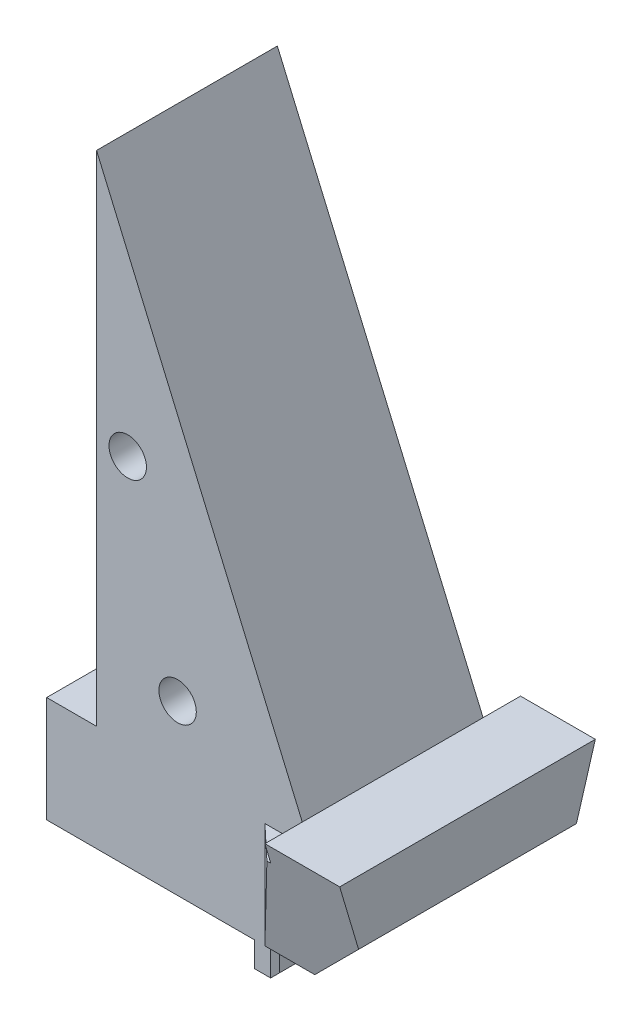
ISO-10303-21;
HEADER;
FILE_DESCRIPTION(('STEP AP214'),'2;1');
FILE_NAME('part.step','',(''),(''),'','','');
FILE_SCHEMA(('AUTOMOTIVE_DESIGN { 1 0 10303 214 1 1 1 1 }'));
ENDSEC;
DATA;
#1=APPLICATION_CONTEXT('core data for automotive mechanical design processes');
#2=APPLICATION_PROTOCOL_DEFINITION('international standard','automotive_design',2000,#1);
#3=PRODUCT_CONTEXT('',#1,'mechanical');
#4=PRODUCT('Part','Part','',(#3));
#5=PRODUCT_RELATED_PRODUCT_CATEGORY('part','',(#4));
#6=PRODUCT_DEFINITION_FORMATION('','',#4);
#7=PRODUCT_DEFINITION_CONTEXT('part definition',#1,'design');
#8=PRODUCT_DEFINITION('design','',#6,#7);
#9=PRODUCT_DEFINITION_SHAPE('','',#8);
#10=(LENGTH_UNIT() NAMED_UNIT(*) SI_UNIT(.MILLI.,.METRE.));
#11=(NAMED_UNIT(*) PLANE_ANGLE_UNIT() SI_UNIT($,.RADIAN.));
#12=(NAMED_UNIT(*) SI_UNIT($,.STERADIAN.) SOLID_ANGLE_UNIT());
#13=UNCERTAINTY_MEASURE_WITH_UNIT(LENGTH_MEASURE(1.E-05),#10,'distance_accuracy_value','');
#14=(GEOMETRIC_REPRESENTATION_CONTEXT(3) GLOBAL_UNCERTAINTY_ASSIGNED_CONTEXT((#13)) GLOBAL_UNIT_ASSIGNED_CONTEXT((#10,
#11,#12)) REPRESENTATION_CONTEXT('',''));
#15=CARTESIAN_POINT('',(0.,0.,0.));
#16=DIRECTION('',(0.,0.,1.));
#17=DIRECTION('',(1.,0.,0.));
#18=AXIS2_PLACEMENT_3D('',#15,#16,#17);
#19=CARTESIAN_POINT('',(12.6385711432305,10.1,-7.3303792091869));
#20=DIRECTION('',(1.,0.,0.));
#21=DIRECTION('',(0.,0.,-1.));
#22=AXIS2_PLACEMENT_3D('',#19,#20,#21);
#23=PLANE('',#22);
#24=DIRECTION('',(0.,-1.,0.));
#25=VECTOR('',#24,1.);
#26=CARTESIAN_POINT('',(12.6385711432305,48.5,7.1696207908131));
#27=LINE('',#26,#25);
#28=CARTESIAN_POINT('',(12.6385711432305,10.1,7.1696207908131));
#29=VERTEX_POINT('',#28);
#30=CARTESIAN_POINT('',(12.6385711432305,8.5,7.1696207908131));
#31=VERTEX_POINT('',#30);
#32=EDGE_CURVE('E236',#29,#31,#27,.T.);
#33=ORIENTED_EDGE('',*,*,#32,.T.);
#34=DIRECTION('',(0.,0.,1.));
#35=VECTOR('',#34,1.);
#36=CARTESIAN_POINT('',(12.6385711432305,8.5,-7.3303792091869));
#37=LINE('',#36,#35);
#38=CARTESIAN_POINT('',(12.6385711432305,8.5,9.69437326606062));
#39=VERTEX_POINT('',#38);
#40=EDGE_CURVE('E292',#31,#39,#37,.T.);
#41=ORIENTED_EDGE('',*,*,#40,.T.);
#42=DIRECTION('',(0.,-0.958606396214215,-0.284734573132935));
#43=VECTOR('',#42,1.);
#44=CARTESIAN_POINT('',(12.6385711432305,10.1,10.1696207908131));
#45=LINE('',#44,#43);
#46=CARTESIAN_POINT('',(12.6385711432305,10.1,10.1696207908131));
#47=VERTEX_POINT('',#46);
#48=EDGE_CURVE('E279',#47,#39,#45,.T.);
#49=ORIENTED_EDGE('',*,*,#48,.F.);
#50=DIRECTION('',(0.,0.,1.));
#51=VECTOR('',#50,1.);
#52=CARTESIAN_POINT('',(12.6385711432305,10.1,-7.3303792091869));
#53=LINE('',#52,#51);
#54=EDGE_CURVE('E298',#29,#47,#53,.T.);
#55=ORIENTED_EDGE('',*,*,#54,.F.);
#56=EDGE_LOOP('',(#33,#41,#49,#55));
#57=FACE_BOUND('',#56,.T.);
#58=ADVANCED_FACE('F54',(#57),#23,.F.);
#59=DIRECTION('',(0.,-1.,0.));
#60=VECTOR('',#59,1.);
#61=CARTESIAN_POINT('',(12.6385711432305,48.5,-7.3303792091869));
#62=LINE('',#61,#60);
#63=CARTESIAN_POINT('',(12.6385711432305,10.1,-7.3303792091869));
#64=VERTEX_POINT('',#63);
#65=CARTESIAN_POINT('',(12.6385711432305,8.5,-7.3303792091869));
#66=VERTEX_POINT('',#65);
#67=EDGE_CURVE('E249',#64,#66,#62,.T.);
#68=ORIENTED_EDGE('',*,*,#67,.F.);
#69=CARTESIAN_POINT('',(12.6385711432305,10.1,-10.3303792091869));
#70=VERTEX_POINT('',#69);
#71=EDGE_CURVE('E293',#70,#64,#53,.T.);
#72=ORIENTED_EDGE('',*,*,#71,.F.);
#73=DIRECTION('',(0.,0.958606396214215,-0.284734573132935));
#74=VECTOR('',#73,1.);
#75=CARTESIAN_POINT('',(12.6385711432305,10.1,-10.3303792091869));
#76=LINE('',#75,#74);
#77=CARTESIAN_POINT('',(12.6385711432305,8.5,-9.85513168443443));
#78=VERTEX_POINT('',#77);
#79=EDGE_CURVE('E272',#78,#70,#76,.T.);
#80=ORIENTED_EDGE('',*,*,#79,.F.);
#81=EDGE_CURVE('E299',#78,#66,#37,.T.);
#82=ORIENTED_EDGE('',*,*,#81,.T.);
#83=EDGE_LOOP('',(#68,#72,#80,#82));
#84=FACE_BOUND('',#83,.T.);
#85=ADVANCED_FACE('F458',(#84),#23,.F.);
#86=CARTESIAN_POINT('',(0.,8.5,0.));
#87=DIRECTION('',(0.,1.,0.));
#88=DIRECTION('',(1.,0.,0.));
#89=AXIS2_PLACEMENT_3D('',#86,#87,#88);
#90=PLANE('',#89);
#91=DIRECTION('',(1.,0.,0.));
#92=VECTOR('',#91,1.);
#93=CARTESIAN_POINT('',(-7.86142916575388,8.5,7.1696207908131));
#94=LINE('',#93,#92);
#95=CARTESIAN_POINT('',(-7.86142916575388,8.5,7.1696207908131));
#96=VERTEX_POINT('',#95);
#97=CARTESIAN_POINT('',(-3.86142916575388,8.5,7.1696207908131));
#98=VERTEX_POINT('',#97);
#99=EDGE_CURVE('E319',#96,#98,#94,.T.);
#100=ORIENTED_EDGE('',*,*,#99,.T.);
#101=DIRECTION('',(0.,0.,1.));
#102=VECTOR('',#101,1.);
#103=CARTESIAN_POINT('',(-3.86142916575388,8.5,-7.3303792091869));
#104=LINE('',#103,#102);
#105=CARTESIAN_POINT('',(-3.86142916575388,8.5,-7.3303792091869));
#106=VERTEX_POINT('',#105);
#107=EDGE_CURVE('E242',#106,#98,#104,.T.);
#108=ORIENTED_EDGE('',*,*,#107,.F.);
#109=DIRECTION('',(-1.,0.,0.));
#110=VECTOR('',#109,1.);
#111=CARTESIAN_POINT('',(-7.86142916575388,8.5,-7.3303792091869));
#112=LINE('',#111,#110);
#113=CARTESIAN_POINT('',(-7.86142916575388,8.5,-7.3303792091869));
#114=VERTEX_POINT('',#113);
#115=EDGE_CURVE('E316',#106,#114,#112,.T.);
#116=ORIENTED_EDGE('',*,*,#115,.T.);
#117=DIRECTION('',(0.,0.,1.));
#118=VECTOR('',#117,1.);
#119=CARTESIAN_POINT('',(-7.86142916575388,8.5,-7.3303792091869));
#120=LINE('',#119,#118);
#121=EDGE_CURVE('E302',#114,#96,#120,.T.);
#122=ORIENTED_EDGE('',*,*,#121,.T.);
#123=EDGE_LOOP('',(#100,#108,#116,#122));
#124=FACE_BOUND('',#123,.T.);
#125=ADVANCED_FACE('F500',(#124),#90,.T.);
#126=ORIENTED_EDGE('',*,*,#40,.F.);
#127=DIRECTION('',(-1.,0.,0.));
#128=VECTOR('',#127,1.);
#129=CARTESIAN_POINT('',(0.,8.5,7.1696207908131));
#130=LINE('',#129,#128);
#131=CARTESIAN_POINT('',(9.63857114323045,8.5,7.1696207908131));
#132=VERTEX_POINT('',#131);
#133=EDGE_CURVE('E11',#31,#132,#130,.T.);
#134=ORIENTED_EDGE('',*,*,#133,.T.);
#135=DIRECTION('',(0.728674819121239,0.,0.684859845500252));
#136=VECTOR('',#135,1.);
#137=CARTESIAN_POINT('',(12.6385711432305,8.5,9.98923179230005));
#138=LINE('',#137,#136);
#139=CARTESIAN_POINT('',(12.3248485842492,8.5,9.69437326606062));
#140=VERTEX_POINT('',#139);
#141=EDGE_CURVE('E253',#132,#140,#138,.T.);
#142=ORIENTED_EDGE('',*,*,#141,.T.);
#143=DIRECTION('',(1.,0.,0.));
#144=VECTOR('',#143,1.);
#145=CARTESIAN_POINT('',(-0.361428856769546,8.5,9.69437326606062));
#146=LINE('',#145,#144);
#147=EDGE_CURVE('E244',#140,#39,#146,.T.);
#148=ORIENTED_EDGE('',*,*,#147,.T.);
#149=EDGE_LOOP('',(#126,#134,#142,#148));
#150=FACE_BOUND('',#149,.T.);
#151=ADVANCED_FACE('F523',(#150),#90,.T.);
#152=DIRECTION('',(-0.732461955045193,0.,0.680807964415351));
#153=VECTOR('',#152,1.);
#154=CARTESIAN_POINT('',(12.6385711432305,8.5,-10.1188160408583));
#155=LINE('',#154,#153);
#156=CARTESIAN_POINT('',(12.3548806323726,8.5,-9.85513168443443));
#157=VERTEX_POINT('',#156);
#158=CARTESIAN_POINT('',(9.63857114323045,8.5,-7.3303792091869));
#159=VERTEX_POINT('',#158);
#160=EDGE_CURVE('E263',#157,#159,#155,.T.);
#161=ORIENTED_EDGE('',*,*,#160,.T.);
#162=DIRECTION('',(-1.,0.,0.));
#163=VECTOR('',#162,1.);
#164=CARTESIAN_POINT('',(-3.86142916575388,8.5,-7.3303792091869));
#165=LINE('',#164,#163);
#166=EDGE_CURVE('E229',#66,#159,#165,.T.);
#167=ORIENTED_EDGE('',*,*,#166,.F.);
#168=ORIENTED_EDGE('',*,*,#81,.F.);
#169=DIRECTION('',(1.,0.,0.));
#170=VECTOR('',#169,1.);
#171=CARTESIAN_POINT('',(-0.361428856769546,8.5,-9.85513168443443));
#172=LINE('',#171,#170);
#173=EDGE_CURVE('E247',#157,#78,#172,.T.);
#174=ORIENTED_EDGE('',*,*,#173,.F.);
#175=EDGE_LOOP('',(#161,#167,#168,#174));
#176=FACE_BOUND('',#175,.T.);
#177=ADVANCED_FACE('F454',(#176),#90,.T.);
#178=CARTESIAN_POINT('',(8.43857114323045,-2.,6.8196207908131));
#179=DIRECTION('',(0.707106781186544,0.,-0.707106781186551));
#180=DIRECTION('',(0.,-1.,0.));
#181=AXIS2_PLACEMENT_3D('',#178,#179,#180);
#182=PLANE('',#181);
#183=DIRECTION('',(0.577350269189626,-0.577350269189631,0.577350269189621));
#184=VECTOR('',#183,1.);
#185=CARTESIAN_POINT('',(6.39869754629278,0.389873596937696,4.77974719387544));
#186=LINE('',#185,#184);
#187=CARTESIAN_POINT('',(8.43857114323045,-1.65,6.8196207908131));
#188=VERTEX_POINT('',#187);
#189=CARTESIAN_POINT('',(8.78857114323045,-2.,7.1696207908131));
#190=VERTEX_POINT('',#189);
#191=EDGE_CURVE('E331',#188,#190,#186,.T.);
#192=ORIENTED_EDGE('',*,*,#191,.T.);
#193=DIRECTION('',(0.,-1.,0.));
#194=VECTOR('',#193,1.);
#195=CARTESIAN_POINT('',(8.78857114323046,-2.,7.1696207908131));
#196=LINE('',#195,#194);
#197=CARTESIAN_POINT('',(8.78857114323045,0.,7.1696207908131));
#198=VERTEX_POINT('',#197);
#199=EDGE_CURVE('E342',#198,#190,#196,.T.);
#200=ORIENTED_EDGE('',*,*,#199,.F.);
#201=DIRECTION('',(0.707106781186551,0.,0.707106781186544));
#202=VECTOR('',#201,1.);
#203=CARTESIAN_POINT('',(8.43857114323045,0.,6.8196207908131));
#204=LINE('',#203,#202);
#205=CARTESIAN_POINT('',(8.43857114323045,0.,6.8196207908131));
#206=VERTEX_POINT('',#205);
#207=EDGE_CURVE('E371',#206,#198,#204,.T.);
#208=ORIENTED_EDGE('',*,*,#207,.F.);
#209=DIRECTION('',(0.,1.,0.));
#210=VECTOR('',#209,1.);
#211=CARTESIAN_POINT('',(8.43857114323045,-2.,6.8196207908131));
#212=LINE('',#211,#210);
#213=EDGE_CURVE('E381',#188,#206,#212,.T.);
#214=ORIENTED_EDGE('',*,*,#213,.F.);
#215=EDGE_LOOP('',(#192,#200,#208,#214));
#216=FACE_BOUND('',#215,.T.);
#217=ADVANCED_FACE('F488',(#216),#182,.F.);
#218=CARTESIAN_POINT('',(8.78857114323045,-2.,0.));
#219=DIRECTION('',(-0.70710678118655,-0.707106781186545,0.));
#220=DIRECTION('',(-0.707106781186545,0.70710678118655,0.));
#221=AXIS2_PLACEMENT_3D('',#218,#219,#220);
#222=PLANE('',#221);
#223=DIRECTION('',(0.577350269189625,-0.577350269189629,0.577350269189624));
#224=VECTOR('',#223,1.);
#225=CARTESIAN_POINT('',(5.85904742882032,0.929523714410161,-9.90990292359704));
#226=LINE('',#225,#224);
#227=CARTESIAN_POINT('',(8.43857114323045,-1.65,-7.33037920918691));
#228=VERTEX_POINT('',#227);
#229=CARTESIAN_POINT('',(8.78857114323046,-2.,-6.98037920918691));
#230=VERTEX_POINT('',#229);
#231=EDGE_CURVE('E328',#228,#230,#226,.T.);
#232=ORIENTED_EDGE('',*,*,#231,.T.);
#233=DIRECTION('',(0.,0.,-1.));
#234=VECTOR('',#233,1.);
#235=CARTESIAN_POINT('',(8.78857114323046,-2.,-7.33037920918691));
#236=LINE('',#235,#234);
#237=EDGE_CURVE('E337',#190,#230,#236,.T.);
#238=ORIENTED_EDGE('',*,*,#237,.F.);
#239=ORIENTED_EDGE('',*,*,#191,.F.);
#240=DIRECTION('',(0.,0.,1.));
#241=VECTOR('',#240,1.);
#242=CARTESIAN_POINT('',(8.43857114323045,-1.65,7.1696207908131));
#243=LINE('',#242,#241);
#244=EDGE_CURVE('E318',#228,#188,#243,.T.);
#245=ORIENTED_EDGE('',*,*,#244,.F.);
#246=EDGE_LOOP('',(#232,#238,#239,#245));
#247=FACE_BOUND('',#246,.T.);
#248=ADVANCED_FACE('F482',(#247),#222,.T.);
#249=CARTESIAN_POINT('',(0.,-2.,-6.98037920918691));
#250=DIRECTION('',(0.,-0.707106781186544,-0.707106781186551));
#251=DIRECTION('',(0.,-0.707106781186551,0.707106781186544));
#252=AXIS2_PLACEMENT_3D('',#249,#250,#251);
#253=PLANE('',#252);
#254=DIRECTION('',(0.,-0.707106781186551,0.707106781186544));
#255=VECTOR('',#254,1.);
#256=CARTESIAN_POINT('',(10.0985711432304,-1.65,-7.3303792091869));
#257=LINE('',#256,#255);
#258=CARTESIAN_POINT('',(10.0985711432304,-1.65,-7.3303792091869));
#259=VERTEX_POINT('',#258);
#260=CARTESIAN_POINT('',(10.0985711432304,-2.,-6.98037920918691));
#261=VERTEX_POINT('',#260);
#262=EDGE_CURVE('E332',#259,#261,#257,.T.);
#263=ORIENTED_EDGE('',*,*,#262,.T.);
#264=DIRECTION('',(1.,0.,0.));
#265=VECTOR('',#264,1.);
#266=CARTESIAN_POINT('',(10.4485711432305,-2.,-6.98037920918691));
#267=LINE('',#266,#265);
#268=EDGE_CURVE('E366',#230,#261,#267,.T.);
#269=ORIENTED_EDGE('',*,*,#268,.F.);
#270=ORIENTED_EDGE('',*,*,#231,.F.);
#271=DIRECTION('',(-1.,0.,0.));
#272=VECTOR('',#271,1.);
#273=CARTESIAN_POINT('',(8.43857114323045,-1.65,-7.33037920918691));
#274=LINE('',#273,#272);
#275=EDGE_CURVE('E352',#259,#228,#274,.T.);
#276=ORIENTED_EDGE('',*,*,#275,.F.);
#277=EDGE_LOOP('',(#263,#269,#270,#276));
#278=FACE_BOUND('',#277,.T.);
#279=ADVANCED_FACE('F475',(#278),#253,.T.);
#280=CARTESIAN_POINT('',(10.0985711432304,-1.65,-7.3303792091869));
#281=DIRECTION('',(0.577350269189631,-0.577350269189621,-0.577350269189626));
#282=DIRECTION('',(0.,-0.707106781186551,0.707106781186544));
#283=AXIS2_PLACEMENT_3D('',#280,#281,#282);
#284=PLANE('',#283);
#285=DIRECTION('',(0.707106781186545,0.,0.70710678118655));
#286=VECTOR('',#285,1.);
#287=CARTESIAN_POINT('',(10.0985711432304,-1.65,-7.3303792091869));
#288=LINE('',#287,#286);
#289=CARTESIAN_POINT('',(10.4485711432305,-1.65,-6.9803792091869));
#290=VERTEX_POINT('',#289);
#291=EDGE_CURVE('E341',#259,#290,#288,.T.);
#292=ORIENTED_EDGE('',*,*,#291,.T.);
#293=DIRECTION('',(-0.707106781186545,-0.70710678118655,0.));
#294=VECTOR('',#293,1.);
#295=CARTESIAN_POINT('',(10.2735711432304,-1.825,-6.98037920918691));
#296=LINE('',#295,#294);
#297=EDGE_CURVE('E356',#290,#261,#296,.T.);
#298=ORIENTED_EDGE('',*,*,#297,.T.);
#299=ORIENTED_EDGE('',*,*,#262,.F.);
#300=EDGE_LOOP('',(#292,#298,#299));
#301=FACE_BOUND('',#300,.T.);
#302=ADVANCED_FACE('F584',(#301),#284,.T.);
#303=CARTESIAN_POINT('',(10.4485711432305,-2.,-6.9803792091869));
#304=DIRECTION('',(-0.70710678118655,0.,0.707106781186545));
#305=DIRECTION('',(0.,1.,0.));
#306=AXIS2_PLACEMENT_3D('',#303,#304,#305);
#307=PLANE('',#306);
#308=DIRECTION('',(-0.707106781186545,0.,-0.70710678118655));
#309=VECTOR('',#308,1.);
#310=CARTESIAN_POINT('',(10.4485711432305,0.,-6.9803792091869));
#311=LINE('',#310,#309);
#312=CARTESIAN_POINT('',(10.4485711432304,0.,-6.9803792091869));
#313=VERTEX_POINT('',#312);
#314=CARTESIAN_POINT('',(10.0985711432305,0.,-7.3303792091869));
#315=VERTEX_POINT('',#314);
#316=EDGE_CURVE('E357',#313,#315,#311,.T.);
#317=ORIENTED_EDGE('',*,*,#316,.F.);
#318=DIRECTION('',(0.,1.,0.));
#319=VECTOR('',#318,1.);
#320=CARTESIAN_POINT('',(10.4485711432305,-2.,-6.9803792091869));
#321=LINE('',#320,#319);
#322=EDGE_CURVE('E346',#290,#313,#321,.T.);
#323=ORIENTED_EDGE('',*,*,#322,.F.);
#324=ORIENTED_EDGE('',*,*,#291,.F.);
#325=DIRECTION('',(0.,-1.,0.));
#326=VECTOR('',#325,1.);
#327=CARTESIAN_POINT('',(10.0985711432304,-2.,-7.3303792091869));
#328=LINE('',#327,#326);
#329=EDGE_CURVE('E358',#315,#259,#328,.T.);
#330=ORIENTED_EDGE('',*,*,#329,.F.);
#331=EDGE_LOOP('',(#317,#323,#324,#330));
#332=FACE_BOUND('',#331,.T.);
#333=ADVANCED_FACE('F470',(#332),#307,.F.);
#334=CARTESIAN_POINT('',(10.0985711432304,-2.,0.));
#335=DIRECTION('',(0.70710678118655,-0.707106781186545,0.));
#336=DIRECTION('',(0.,0.,-1.));
#337=AXIS2_PLACEMENT_3D('',#334,#335,#336);
#338=PLANE('',#337);
#339=DIRECTION('',(-0.577350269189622,-0.577350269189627,0.577350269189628));
#340=VECTOR('',#339,1.);
#341=CARTESIAN_POINT('',(12.4884447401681,0.389873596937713,4.77974719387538));
#342=LINE('',#341,#340);
#343=CARTESIAN_POINT('',(10.4485711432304,-1.65,6.81962079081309));
#344=VERTEX_POINT('',#343);
#345=CARTESIAN_POINT('',(10.0985711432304,-2.,7.1696207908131));
#346=VERTEX_POINT('',#345);
#347=EDGE_CURVE('E353',#344,#346,#342,.T.);
#348=ORIENTED_EDGE('',*,*,#347,.T.);
#349=DIRECTION('',(0.,0.,1.));
#350=VECTOR('',#349,1.);
#351=CARTESIAN_POINT('',(10.0985711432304,-2.,7.1696207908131));
#352=LINE('',#351,#350);
#353=EDGE_CURVE('E367',#261,#346,#352,.T.);
#354=ORIENTED_EDGE('',*,*,#353,.F.);
#355=ORIENTED_EDGE('',*,*,#297,.F.);
#356=DIRECTION('',(0.,0.,-1.));
#357=VECTOR('',#356,1.);
#358=CARTESIAN_POINT('',(10.4485711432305,-1.65,-7.3303792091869));
#359=LINE('',#358,#357);
#360=EDGE_CURVE('E386',#344,#290,#359,.T.);
#361=ORIENTED_EDGE('',*,*,#360,.F.);
#362=EDGE_LOOP('',(#348,#354,#355,#361));
#363=FACE_BOUND('',#362,.T.);
#364=ADVANCED_FACE('F567',(#363),#338,.T.);
#365=CARTESIAN_POINT('',(10.0985711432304,-2.,7.1696207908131));
#366=DIRECTION('',(-0.707106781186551,0.,-0.707106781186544));
#367=DIRECTION('',(-0.707106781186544,0.,0.707106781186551));
#368=AXIS2_PLACEMENT_3D('',#365,#366,#367);
#369=PLANE('',#368);
#370=DIRECTION('',(0.707106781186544,0.,-0.707106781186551));
#371=VECTOR('',#370,1.);
#372=CARTESIAN_POINT('',(10.0985711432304,0.,7.1696207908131));
#373=LINE('',#372,#371);
#374=CARTESIAN_POINT('',(10.0985711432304,0.,7.1696207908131));
#375=VERTEX_POINT('',#374);
#376=CARTESIAN_POINT('',(10.4485711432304,0.,6.81962079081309));
#377=VERTEX_POINT('',#376);
#378=EDGE_CURVE('E385',#375,#377,#373,.T.);
#379=ORIENTED_EDGE('',*,*,#378,.F.);
#380=DIRECTION('',(0.,1.,0.));
#381=VECTOR('',#380,1.);
#382=CARTESIAN_POINT('',(10.0985711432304,-2.,7.1696207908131));
#383=LINE('',#382,#381);
#384=EDGE_CURVE('E333',#346,#375,#383,.T.);
#385=ORIENTED_EDGE('',*,*,#384,.F.);
#386=ORIENTED_EDGE('',*,*,#347,.F.);
#387=DIRECTION('',(0.,-1.,0.));
#388=VECTOR('',#387,1.);
#389=CARTESIAN_POINT('',(10.4485711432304,-2.,6.81962079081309));
#390=LINE('',#389,#388);
#391=EDGE_CURVE('E351',#377,#344,#390,.T.);
#392=ORIENTED_EDGE('',*,*,#391,.F.);
#393=EDGE_LOOP('',(#379,#385,#386,#392));
#394=FACE_BOUND('',#393,.T.);
#395=ADVANCED_FACE('F509',(#394),#369,.F.);
#396=CARTESIAN_POINT('',(0.,-2.,0.));
#397=DIRECTION('',(0.,-1.,0.));
#398=DIRECTION('',(0.,0.,-1.));
#399=AXIS2_PLACEMENT_3D('',#396,#397,#398);
#400=PLANE('',#399);
#401=DIRECTION('',(-1.,0.,0.));
#402=VECTOR('',#401,1.);
#403=CARTESIAN_POINT('',(8.43857114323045,-2.,7.1696207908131));
#404=LINE('',#403,#402);
#405=EDGE_CURVE('E338',#346,#190,#404,.T.);
#406=ORIENTED_EDGE('',*,*,#405,.T.);
#407=ORIENTED_EDGE('',*,*,#237,.T.);
#408=ORIENTED_EDGE('',*,*,#268,.T.);
#409=ORIENTED_EDGE('',*,*,#353,.T.);
#410=EDGE_LOOP('',(#406,#407,#408,#409));
#411=FACE_BOUND('',#410,.T.);
#412=ADVANCED_FACE('F504',(#411),#400,.T.);
#413=CARTESIAN_POINT('',(8.43857114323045,-2.,7.1696207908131));
#414=DIRECTION('',(0.,0.,-1.));
#415=DIRECTION('',(0.,-1.,0.));
#416=AXIS2_PLACEMENT_3D('',#413,#414,#415);
#417=PLANE('',#416);
#418=CARTESIAN_POINT('',(-1.36142885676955,28.5,7.1696207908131));
#419=DIRECTION('',(0.,0.,1.));
#420=DIRECTION('',(1.,0.,0.));
#421=AXIS2_PLACEMENT_3D('',#418,#419,#420);
#422=CIRCLE('',#421,1.5);
#423=CARTESIAN_POINT('',(0.138571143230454,28.5,7.1696207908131));
#424=VERTEX_POINT('',#423);
#425=EDGE_CURVE('E439',#424,#424,#422,.T.);
#426=ORIENTED_EDGE('',*,*,#425,.F.);
#427=EDGE_LOOP('',(#426));
#428=FACE_BOUND('',#427,.T.);
#429=CARTESIAN_POINT('',(2.63857114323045,13.5,7.1696207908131));
#430=DIRECTION('',(0.,0.,1.));
#431=DIRECTION('',(1.,0.,0.));
#432=AXIS2_PLACEMENT_3D('',#429,#430,#431);
#433=CIRCLE('',#432,1.5);
#434=CARTESIAN_POINT('',(4.13857114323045,13.5,7.1696207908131));
#435=VERTEX_POINT('',#434);
#436=EDGE_CURVE('E431',#435,#435,#433,.T.);
#437=ORIENTED_EDGE('',*,*,#436,.F.);
#438=EDGE_LOOP('',(#437));
#439=FACE_BOUND('',#438,.T.);
#440=ORIENTED_EDGE('',*,*,#32,.F.);
#441=DIRECTION('',(0.394785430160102,-0.918773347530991,0.));
#442=VECTOR('',#441,1.);
#443=CARTESIAN_POINT('',(-3.86142916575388,48.5,7.1696207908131));
#444=LINE('',#443,#442);
#445=CARTESIAN_POINT('',(-3.86142916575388,48.5,7.1696207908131));
#446=VERTEX_POINT('',#445);
#447=EDGE_CURVE('E221',#446,#29,#444,.T.);
#448=ORIENTED_EDGE('',*,*,#447,.F.);
#449=DIRECTION('',(0.,-1.,0.));
#450=VECTOR('',#449,1.);
#451=CARTESIAN_POINT('',(-3.86142916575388,48.5,7.1696207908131));
#452=LINE('',#451,#450);
#453=EDGE_CURVE('E233',#446,#98,#452,.T.);
#454=ORIENTED_EDGE('',*,*,#453,.T.);
#455=ORIENTED_EDGE('',*,*,#99,.F.);
#456=DIRECTION('',(0.,-1.,0.));
#457=VECTOR('',#456,1.);
#458=CARTESIAN_POINT('',(-7.86142916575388,4.5,7.1696207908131));
#459=LINE('',#458,#457);
#460=CARTESIAN_POINT('',(-7.86142916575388,0.,7.1696207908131));
#461=VERTEX_POINT('',#460);
#462=EDGE_CURVE('E307',#96,#461,#459,.T.);
#463=ORIENTED_EDGE('',*,*,#462,.T.);
#464=DIRECTION('',(1.,0.,0.));
#465=VECTOR('',#464,1.);
#466=CARTESIAN_POINT('',(8.43857083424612,0.,7.1696207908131));
#467=LINE('',#466,#465);
#468=EDGE_CURVE('E310',#461,#198,#467,.T.);
#469=ORIENTED_EDGE('',*,*,#468,.T.);
#470=ORIENTED_EDGE('',*,*,#199,.T.);
#471=ORIENTED_EDGE('',*,*,#405,.F.);
#472=ORIENTED_EDGE('',*,*,#384,.T.);
#473=DIRECTION('',(-1.,0.,0.));
#474=VECTOR('',#473,1.);
#475=CARTESIAN_POINT('',(9.63857114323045,0.,7.1696207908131));
#476=LINE('',#475,#474);
#477=CARTESIAN_POINT('',(9.63857114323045,0.,7.1696207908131));
#478=VERTEX_POINT('',#477);
#479=EDGE_CURVE('E255',#375,#478,#476,.T.);
#480=ORIENTED_EDGE('',*,*,#479,.T.);
#481=DIRECTION('',(0.,1.,0.));
#482=VECTOR('',#481,1.);
#483=CARTESIAN_POINT('',(9.63857114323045,0.,7.1696207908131));
#484=LINE('',#483,#482);
#485=EDGE_CURVE('E258',#478,#132,#484,.T.);
#486=ORIENTED_EDGE('',*,*,#485,.T.);
#487=ORIENTED_EDGE('',*,*,#133,.F.);
#488=EDGE_LOOP('',(#440,#448,#454,#455,#463,#469,#470,#471,#472,#480,#486,#487));
#489=FACE_BOUND('',#488,.T.);
#490=ADVANCED_FACE('F232',(#428,#439,#489),#417,.F.);
#491=CARTESIAN_POINT('',(10.4485711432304,-2.,7.1696207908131));
#492=DIRECTION('',(-1.,0.,0.));
#493=DIRECTION('',(0.,0.,1.));
#494=AXIS2_PLACEMENT_3D('',#491,#492,#493);
#495=PLANE('',#494);
#496=DIRECTION('',(0.,0.,1.));
#497=VECTOR('',#496,1.);
#498=CARTESIAN_POINT('',(10.4485711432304,0.,7.1696207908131));
#499=LINE('',#498,#497);
#500=EDGE_CURVE('E347',#313,#377,#499,.T.);
#501=ORIENTED_EDGE('',*,*,#500,.T.);
#502=ORIENTED_EDGE('',*,*,#391,.T.);
#503=ORIENTED_EDGE('',*,*,#360,.T.);
#504=ORIENTED_EDGE('',*,*,#322,.T.);
#505=EDGE_LOOP('',(#501,#502,#503,#504));
#506=FACE_BOUND('',#505,.T.);
#507=ADVANCED_FACE('F563',(#506),#495,.F.);
#508=CARTESIAN_POINT('',(8.43857114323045,-2.,-7.33037920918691));
#509=DIRECTION('',(0.,0.,1.));
#510=DIRECTION('',(1.,0.,0.));
#511=AXIS2_PLACEMENT_3D('',#508,#509,#510);
#512=PLANE('',#511);
#513=CARTESIAN_POINT('',(-1.36142885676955,28.5,-7.33037920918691));
#514=DIRECTION('',(0.,0.,1.));
#515=DIRECTION('',(1.,0.,0.));
#516=AXIS2_PLACEMENT_3D('',#513,#514,#515);
#517=CIRCLE('',#516,1.5);
#518=CARTESIAN_POINT('',(0.138571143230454,28.5,-7.33037920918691));
#519=VERTEX_POINT('',#518);
#520=EDGE_CURVE('E59',#519,#519,#517,.T.);
#521=ORIENTED_EDGE('',*,*,#520,.T.);
#522=EDGE_LOOP('',(#521));
#523=FACE_BOUND('',#522,.T.);
#524=CARTESIAN_POINT('',(2.63857114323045,13.5,-7.33037920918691));
#525=DIRECTION('',(0.,0.,1.));
#526=DIRECTION('',(1.,0.,0.));
#527=AXIS2_PLACEMENT_3D('',#524,#525,#526);
#528=CIRCLE('',#527,1.5);
#529=CARTESIAN_POINT('',(4.13857114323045,13.5,-7.33037920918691));
#530=VERTEX_POINT('',#529);
#531=EDGE_CURVE('E238',#530,#530,#528,.T.);
#532=ORIENTED_EDGE('',*,*,#531,.T.);
#533=EDGE_LOOP('',(#532));
#534=FACE_BOUND('',#533,.T.);
#535=DIRECTION('',(0.,-1.,0.));
#536=VECTOR('',#535,1.);
#537=CARTESIAN_POINT('',(-3.86142916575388,48.5,-7.3303792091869));
#538=LINE('',#537,#536);
#539=CARTESIAN_POINT('',(-3.86142916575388,48.5,-7.3303792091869));
#540=VERTEX_POINT('',#539);
#541=EDGE_CURVE('E228',#540,#106,#538,.T.);
#542=ORIENTED_EDGE('',*,*,#541,.F.);
#543=DIRECTION('',(0.394785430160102,-0.918773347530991,0.));
#544=VECTOR('',#543,1.);
#545=CARTESIAN_POINT('',(16.3728697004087,1.40926897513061,-7.33037920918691));
#546=LINE('',#545,#544);
#547=EDGE_CURVE('E224',#540,#64,#546,.T.);
#548=ORIENTED_EDGE('',*,*,#547,.T.);
#549=ORIENTED_EDGE('',*,*,#67,.T.);
#550=ORIENTED_EDGE('',*,*,#166,.T.);
#551=DIRECTION('',(0.,1.,0.));
#552=VECTOR('',#551,1.);
#553=CARTESIAN_POINT('',(9.63857114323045,0.,-7.3303792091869));
#554=LINE('',#553,#552);
#555=CARTESIAN_POINT('',(9.63857114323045,0.,-7.3303792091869));
#556=VERTEX_POINT('',#555);
#557=EDGE_CURVE('E267',#556,#159,#554,.T.);
#558=ORIENTED_EDGE('',*,*,#557,.F.);
#559=DIRECTION('',(1.,0.,0.));
#560=VECTOR('',#559,1.);
#561=CARTESIAN_POINT('',(9.63857114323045,0.,-7.3303792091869));
#562=LINE('',#561,#560);
#563=EDGE_CURVE('E264',#556,#315,#562,.T.);
#564=ORIENTED_EDGE('',*,*,#563,.T.);
#565=ORIENTED_EDGE('',*,*,#329,.T.);
#566=ORIENTED_EDGE('',*,*,#275,.T.);
#567=DIRECTION('',(0.,1.,0.));
#568=VECTOR('',#567,1.);
#569=CARTESIAN_POINT('',(8.43857114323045,-2.,-7.33037920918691));
#570=LINE('',#569,#568);
#571=CARTESIAN_POINT('',(8.43857114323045,0.,-7.33037920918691));
#572=VERTEX_POINT('',#571);
#573=EDGE_CURVE('E362',#228,#572,#570,.T.);
#574=ORIENTED_EDGE('',*,*,#573,.T.);
#575=DIRECTION('',(-1.,0.,0.));
#576=VECTOR('',#575,1.);
#577=CARTESIAN_POINT('',(-7.86142916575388,0.,-7.3303792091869));
#578=LINE('',#577,#576);
#579=CARTESIAN_POINT('',(-7.86142916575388,0.,-7.3303792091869));
#580=VERTEX_POINT('',#579);
#581=EDGE_CURVE('E296',#572,#580,#578,.T.);
#582=ORIENTED_EDGE('',*,*,#581,.T.);
#583=DIRECTION('',(0.,-1.,0.));
#584=VECTOR('',#583,1.);
#585=CARTESIAN_POINT('',(-7.86142916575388,4.5,-7.3303792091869));
#586=LINE('',#585,#584);
#587=EDGE_CURVE('E306',#114,#580,#586,.T.);
#588=ORIENTED_EDGE('',*,*,#587,.F.);
#589=ORIENTED_EDGE('',*,*,#115,.F.);
#590=EDGE_LOOP('',(#542,#548,#549,#550,#558,#564,#565,#566,#574,#582,#588,#589));
#591=FACE_BOUND('',#590,.T.);
#592=ADVANCED_FACE('F448',(#523,#534,#591),#512,.F.);
#593=CARTESIAN_POINT('',(8.43857114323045,-2.,7.1696207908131));
#594=DIRECTION('',(1.,0.,0.));
#595=DIRECTION('',(0.,0.,1.));
#596=AXIS2_PLACEMENT_3D('',#593,#594,#595);
#597=PLANE('',#596);
#598=ORIENTED_EDGE('',*,*,#244,.T.);
#599=ORIENTED_EDGE('',*,*,#213,.T.);
#600=DIRECTION('',(0.,0.,-1.));
#601=VECTOR('',#600,1.);
#602=CARTESIAN_POINT('',(8.43857114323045,0.,7.1696207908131));
#603=LINE('',#602,#601);
#604=EDGE_CURVE('E399',#206,#572,#603,.T.);
#605=ORIENTED_EDGE('',*,*,#604,.T.);
#606=ORIENTED_EDGE('',*,*,#573,.F.);
#607=EDGE_LOOP('',(#598,#599,#605,#606));
#608=FACE_BOUND('',#607,.T.);
#609=ADVANCED_FACE('F480',(#608),#597,.F.);
#610=CARTESIAN_POINT('',(0.,0.,0.));
#611=DIRECTION('',(0.,-1.,0.));
#612=DIRECTION('',(0.,0.,-1.));
#613=AXIS2_PLACEMENT_3D('',#610,#611,#612);
#614=PLANE('',#613);
#615=CARTESIAN_POINT('',(13.6385711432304,0.,-7.3303792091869));
#616=VERTEX_POINT('',#615);
#617=EDGE_CURVE('E308',#616,#315,#578,.T.);
#618=ORIENTED_EDGE('',*,*,#617,.F.);
#619=DIRECTION('',(0.,0.,1.));
#620=VECTOR('',#619,1.);
#621=CARTESIAN_POINT('',(13.6385711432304,0.,0.));
#622=LINE('',#621,#620);
#623=CARTESIAN_POINT('',(13.6385711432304,0.,7.1696207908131));
#624=VERTEX_POINT('',#623);
#625=EDGE_CURVE('E72',#616,#624,#622,.T.);
#626=ORIENTED_EDGE('',*,*,#625,.T.);
#627=DIRECTION('',(-1.,0.,0.));
#628=VECTOR('',#627,1.);
#629=CARTESIAN_POINT('',(18.6385711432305,0.,7.1696207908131));
#630=LINE('',#629,#628);
#631=EDGE_CURVE('E285',#624,#375,#630,.T.);
#632=ORIENTED_EDGE('',*,*,#631,.T.);
#633=ORIENTED_EDGE('',*,*,#378,.T.);
#634=ORIENTED_EDGE('',*,*,#500,.F.);
#635=ORIENTED_EDGE('',*,*,#316,.T.);
#636=EDGE_LOOP('',(#618,#626,#632,#633,#634,#635));
#637=FACE_BOUND('',#636,.T.);
#638=ADVANCED_FACE('F466',(#637),#614,.T.);
#639=ORIENTED_EDGE('',*,*,#207,.T.);
#640=ORIENTED_EDGE('',*,*,#468,.F.);
#641=DIRECTION('',(0.,0.,1.));
#642=VECTOR('',#641,1.);
#643=CARTESIAN_POINT('',(-7.86142916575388,0.,7.1696207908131));
#644=LINE('',#643,#642);
#645=EDGE_CURVE('E313',#580,#461,#644,.T.);
#646=ORIENTED_EDGE('',*,*,#645,.F.);
#647=ORIENTED_EDGE('',*,*,#581,.F.);
#648=ORIENTED_EDGE('',*,*,#604,.F.);
#649=EDGE_LOOP('',(#639,#640,#646,#647,#648));
#650=FACE_BOUND('',#649,.T.);
#651=ADVANCED_FACE('F491',(#650),#614,.T.);
#652=CARTESIAN_POINT('',(-7.86142916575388,4.5,7.1696207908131));
#653=DIRECTION('',(1.,0.,0.));
#654=DIRECTION('',(0.,0.,-1.));
#655=AXIS2_PLACEMENT_3D('',#652,#653,#654);
#656=PLANE('',#655);
#657=ORIENTED_EDGE('',*,*,#645,.T.);
#658=ORIENTED_EDGE('',*,*,#462,.F.);
#659=ORIENTED_EDGE('',*,*,#121,.F.);
#660=ORIENTED_EDGE('',*,*,#587,.T.);
#661=EDGE_LOOP('',(#657,#658,#659,#660));
#662=FACE_BOUND('',#661,.T.);
#663=ADVANCED_FACE('F497',(#662),#656,.F.);
#664=CARTESIAN_POINT('',(0.,10.1,0.));
#665=DIRECTION('',(0.,-1.,0.));
#666=DIRECTION('',(0.,0.,-1.));
#667=AXIS2_PLACEMENT_3D('',#664,#665,#666);
#668=PLANE('',#667);
#669=EDGE_CURVE('E297',#64,#29,#53,.T.);
#670=ORIENTED_EDGE('',*,*,#669,.T.);
#671=ORIENTED_EDGE('',*,*,#54,.T.);
#672=DIRECTION('',(-1.,0.,0.));
#673=VECTOR('',#672,1.);
#674=CARTESIAN_POINT('',(18.6385711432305,10.1,10.1696207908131));
#675=LINE('',#674,#673);
#676=CARTESIAN_POINT('',(18.6385711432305,10.1,10.1696207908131));
#677=VERTEX_POINT('',#676);
#678=EDGE_CURVE('E287',#677,#47,#675,.T.);
#679=ORIENTED_EDGE('',*,*,#678,.F.);
#680=DIRECTION('',(0.,0.,1.));
#681=VECTOR('',#680,1.);
#682=CARTESIAN_POINT('',(18.6385711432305,10.1,7.1696207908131));
#683=LINE('',#682,#681);
#684=CARTESIAN_POINT('',(18.6385711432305,10.1,-10.3303792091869));
#685=VERTEX_POINT('',#684);
#686=EDGE_CURVE('E290',#685,#677,#683,.T.);
#687=ORIENTED_EDGE('',*,*,#686,.F.);
#688=DIRECTION('',(-1.,0.,0.));
#689=VECTOR('',#688,1.);
#690=CARTESIAN_POINT('',(18.6385711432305,10.1,-10.3303792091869));
#691=LINE('',#690,#689);
#692=EDGE_CURVE('E276',#685,#70,#691,.T.);
#693=ORIENTED_EDGE('',*,*,#692,.T.);
#694=ORIENTED_EDGE('',*,*,#71,.T.);
#695=EDGE_LOOP('',(#670,#671,#679,#687,#693,#694));
#696=FACE_BOUND('',#695,.T.);
#697=ADVANCED_FACE('F529',(#696),#668,.F.);
#698=CARTESIAN_POINT('',(18.6385711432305,0.,0.));
#699=DIRECTION('',(1.,0.,0.));
#700=DIRECTION('',(0.,0.,-1.));
#701=AXIS2_PLACEMENT_3D('',#698,#699,#700);
#702=PLANE('',#701);
#703=DIRECTION('',(0.,-0.958606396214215,-0.284734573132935));
#704=VECTOR('',#703,1.);
#705=CARTESIAN_POINT('',(18.6385711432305,10.1,10.1696207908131));
#706=LINE('',#705,#704);
#707=CARTESIAN_POINT('',(18.6385711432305,5.,8.65476930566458));
#708=VERTEX_POINT('',#707);
#709=EDGE_CURVE('E282',#677,#708,#706,.T.);
#710=ORIENTED_EDGE('',*,*,#709,.T.);
#711=DIRECTION('',(0.,0.,-1.));
#712=VECTOR('',#711,1.);
#713=CARTESIAN_POINT('',(18.6385711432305,5.,0.));
#714=LINE('',#713,#712);
#715=CARTESIAN_POINT('',(18.6385711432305,5.,-8.81552772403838));
#716=VERTEX_POINT('',#715);
#717=EDGE_CURVE('E425',#708,#716,#714,.T.);
#718=ORIENTED_EDGE('',*,*,#717,.T.);
#719=DIRECTION('',(0.,0.958606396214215,-0.284734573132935));
#720=VECTOR('',#719,1.);
#721=CARTESIAN_POINT('',(18.6385711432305,10.1,-10.3303792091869));
#722=LINE('',#721,#720);
#723=EDGE_CURVE('E274',#716,#685,#722,.T.);
#724=ORIENTED_EDGE('',*,*,#723,.T.);
#725=ORIENTED_EDGE('',*,*,#686,.T.);
#726=EDGE_LOOP('',(#710,#718,#724,#725));
#727=FACE_BOUND('',#726,.T.);
#728=ADVANCED_FACE('F533',(#727),#702,.T.);
#729=CARTESIAN_POINT('',(18.6385711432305,10.1,10.1696207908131));
#730=DIRECTION('',(0.,0.284734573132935,-0.958606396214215));
#731=DIRECTION('',(0.,0.958606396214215,0.284734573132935));
#732=AXIS2_PLACEMENT_3D('',#729,#730,#731);
#733=PLANE('',#732);
#734=ORIENTED_EDGE('',*,*,#631,.F.);
#735=DIRECTION('',(-0.692008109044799,-0.692008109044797,-0.205546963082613));
#736=VECTOR('',#735,1.);
#737=CARTESIAN_POINT('',(17.4075153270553,3.76894418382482,8.28910916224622));
#738=LINE('',#737,#736);
#739=EDGE_CURVE('E64',#624,#708,#738,.F.);
#740=ORIENTED_EDGE('',*,*,#739,.T.);
#741=ORIENTED_EDGE('',*,*,#709,.F.);
#742=ORIENTED_EDGE('',*,*,#678,.T.);
#743=ORIENTED_EDGE('',*,*,#48,.T.);
#744=ORIENTED_EDGE('',*,*,#147,.F.);
#745=DIRECTION('',(-0.289937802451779,-0.917429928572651,-0.272503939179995));
#746=VECTOR('',#745,1.);
#747=CARTESIAN_POINT('',(10.113538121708,1.50290482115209,7.61602816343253));
#748=LINE('',#747,#746);
#749=EDGE_CURVE('E414',#140,#478,#748,.T.);
#750=ORIENTED_EDGE('',*,*,#749,.T.);
#751=ORIENTED_EDGE('',*,*,#479,.F.);
#752=EDGE_LOOP('',(#734,#740,#741,#742,#743,#744,#750,#751));
#753=FACE_BOUND('',#752,.T.);
#754=ADVANCED_FACE('F515',(#753),#733,.F.);
#755=CARTESIAN_POINT('',(18.6385711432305,10.1,-10.3303792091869));
#756=DIRECTION('',(0.,0.284734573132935,0.958606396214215));
#757=DIRECTION('',(0.,-0.958606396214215,0.284734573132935));
#758=AXIS2_PLACEMENT_3D('',#755,#756,#757);
#759=PLANE('',#758);
#760=ORIENTED_EDGE('',*,*,#723,.F.);
#761=DIRECTION('',(0.692008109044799,0.692008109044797,-0.205546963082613));
#762=VECTOR('',#761,1.);
#763=CARTESIAN_POINT('',(17.3846490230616,3.74607787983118,-8.44307560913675));
#764=LINE('',#763,#762);
#765=EDGE_CURVE('E80',#716,#616,#764,.F.);
#766=ORIENTED_EDGE('',*,*,#765,.T.);
#767=ORIENTED_EDGE('',*,*,#617,.T.);
#768=ORIENTED_EDGE('',*,*,#563,.F.);
#769=DIRECTION('',(0.292902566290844,0.916564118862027,-0.27224676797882));
#770=VECTOR('',#769,1.);
#771=CARTESIAN_POINT('',(10.1183017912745,1.50119510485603,-7.77627874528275));
#772=LINE('',#771,#770);
#773=EDGE_CURVE('E423',#556,#157,#772,.T.);
#774=ORIENTED_EDGE('',*,*,#773,.T.);
#775=ORIENTED_EDGE('',*,*,#173,.T.);
#776=ORIENTED_EDGE('',*,*,#79,.T.);
#777=ORIENTED_EDGE('',*,*,#692,.F.);
#778=EDGE_LOOP('',(#760,#766,#767,#768,#774,#775,#776,#777));
#779=FACE_BOUND('',#778,.T.);
#780=ADVANCED_FACE('F460',(#779),#759,.F.);
#781=CARTESIAN_POINT('',(12.6385711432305,0.,-10.1188160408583));
#782=DIRECTION('',(-0.680807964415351,0.,-0.732461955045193));
#783=DIRECTION('',(-0.732461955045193,0.,0.680807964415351));
#784=AXIS2_PLACEMENT_3D('',#781,#782,#783);
#785=PLANE('',#784);
#786=ORIENTED_EDGE('',*,*,#773,.F.);
#787=ORIENTED_EDGE('',*,*,#557,.T.);
#788=ORIENTED_EDGE('',*,*,#160,.F.);
#789=EDGE_LOOP('',(#786,#787,#788));
#790=FACE_BOUND('',#789,.T.);
#791=ADVANCED_FACE('F463',(#790),#785,.T.);
#792=CARTESIAN_POINT('',(12.6385711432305,0.,9.98923179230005));
#793=DIRECTION('',(-0.684859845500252,0.,0.72867481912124));
#794=DIRECTION('',(0.72867481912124,0.,0.684859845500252));
#795=AXIS2_PLACEMENT_3D('',#792,#793,#794);
#796=PLANE('',#795);
#797=ORIENTED_EDGE('',*,*,#749,.F.);
#798=ORIENTED_EDGE('',*,*,#141,.F.);
#799=ORIENTED_EDGE('',*,*,#485,.F.);
#800=EDGE_LOOP('',(#797,#798,#799));
#801=FACE_BOUND('',#800,.T.);
#802=ADVANCED_FACE('F520',(#801),#796,.T.);
#803=CARTESIAN_POINT('',(18.6385711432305,5.,0.));
#804=DIRECTION('',(-0.707106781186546,0.707106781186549,0.));
#805=DIRECTION('',(0.,0.,-1.));
#806=AXIS2_PLACEMENT_3D('',#803,#804,#805);
#807=PLANE('',#806);
#808=ORIENTED_EDGE('',*,*,#739,.F.);
#809=ORIENTED_EDGE('',*,*,#625,.F.);
#810=ORIENTED_EDGE('',*,*,#765,.F.);
#811=ORIENTED_EDGE('',*,*,#717,.F.);
#812=EDGE_LOOP('',(#808,#809,#810,#811));
#813=FACE_BOUND('',#812,.T.);
#814=ADVANCED_FACE('F57',(#813),#807,.F.);
#815=CARTESIAN_POINT('',(-3.86142916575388,48.5,-7.3303792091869));
#816=DIRECTION('',(1.,0.,0.));
#817=DIRECTION('',(0.,0.,-1.));
#818=AXIS2_PLACEMENT_3D('',#815,#816,#817);
#819=PLANE('',#818);
#820=ORIENTED_EDGE('',*,*,#107,.T.);
#821=ORIENTED_EDGE('',*,*,#453,.F.);
#822=DIRECTION('',(0.,0.,1.));
#823=VECTOR('',#822,1.);
#824=CARTESIAN_POINT('',(-3.86142916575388,48.5,-7.3303792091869));
#825=LINE('',#824,#823);
#826=EDGE_CURVE('E218',#540,#446,#825,.T.);
#827=ORIENTED_EDGE('',*,*,#826,.F.);
#828=ORIENTED_EDGE('',*,*,#541,.T.);
#829=EDGE_LOOP('',(#820,#821,#827,#828));
#830=FACE_BOUND('',#829,.T.);
#831=ADVANCED_FACE('F240',(#830),#819,.F.);
#832=CARTESIAN_POINT('',(-3.86142916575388,48.5,-32.8303792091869));
#833=DIRECTION('',(-0.918773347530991,-0.394785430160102,0.));
#834=DIRECTION('',(0.394785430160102,-0.918773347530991,0.));
#835=AXIS2_PLACEMENT_3D('',#832,#833,#834);
#836=PLANE('',#835);
#837=ORIENTED_EDGE('',*,*,#826,.T.);
#838=ORIENTED_EDGE('',*,*,#447,.T.);
#839=ORIENTED_EDGE('',*,*,#669,.F.);
#840=ORIENTED_EDGE('',*,*,#547,.F.);
#841=EDGE_LOOP('',(#837,#838,#839,#840));
#842=FACE_BOUND('',#841,.T.);
#843=ADVANCED_FACE('F220',(#842),#836,.F.);
#844=CARTESIAN_POINT('',(2.63857114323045,13.5,-24.8303792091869));
#845=DIRECTION('',(0.,0.,1.));
#846=DIRECTION('',(1.,0.,0.));
#847=AXIS2_PLACEMENT_3D('',#844,#845,#846);
#848=CYLINDRICAL_SURFACE('',#847,1.5);
#849=ORIENTED_EDGE('',*,*,#436,.T.);
#850=EDGE_LOOP('',(#849));
#851=FACE_BOUND('',#850,.T.);
#852=ORIENTED_EDGE('',*,*,#531,.F.);
#853=EDGE_LOOP('',(#852));
#854=FACE_BOUND('',#853,.T.);
#855=ADVANCED_FACE('F790',(#851,#854),#848,.F.);
#856=CARTESIAN_POINT('',(-1.36142885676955,28.5,-12.8303792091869));
#857=DIRECTION('',(0.,0.,1.));
#858=DIRECTION('',(1.,0.,0.));
#859=AXIS2_PLACEMENT_3D('',#856,#857,#858);
#860=CYLINDRICAL_SURFACE('',#859,1.5);
#861=ORIENTED_EDGE('',*,*,#425,.T.);
#862=EDGE_LOOP('',(#861));
#863=FACE_BOUND('',#862,.T.);
#864=ORIENTED_EDGE('',*,*,#520,.F.);
#865=EDGE_LOOP('',(#864));
#866=FACE_BOUND('',#865,.T.);
#867=ADVANCED_FACE('F799',(#863,#866),#860,.F.);
#868=CLOSED_SHELL('',(#58,#85,#125,#151,#177,#217,#248,#279,#302,#333,#364,#395,#412,#490,#507,
#592,#609,#638,#651,#663,#697,#728,#754,#780,#791,#802,#814,#831,#843,#855,#867));
#869=MANIFOLD_SOLID_BREP('B2',#868);
#870=ADVANCED_BREP_SHAPE_REPRESENTATION('',(#18,#869),#14);
#871=SHAPE_DEFINITION_REPRESENTATION(#9,#870);
ENDSEC;
END-ISO-10303-21;
